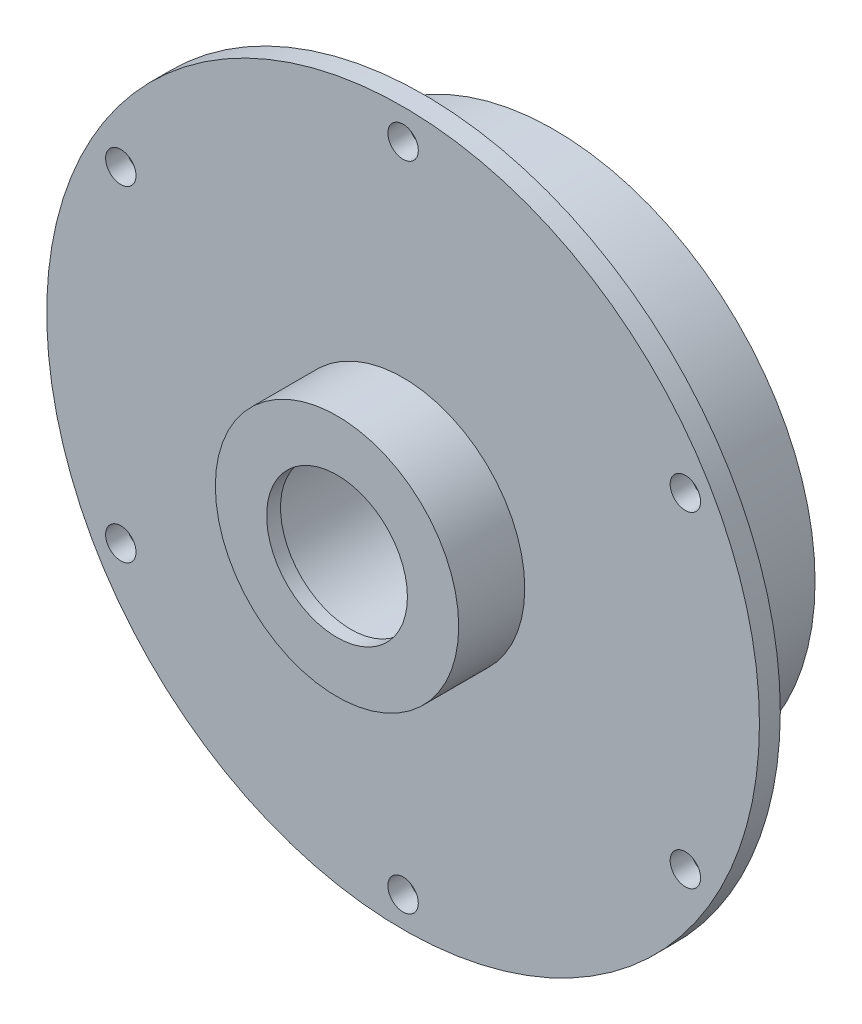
ISO-10303-21;
HEADER;
FILE_DESCRIPTION(('STEP AP214'),'2;1');
FILE_NAME('part.step','',(''),(''),'','','');
FILE_SCHEMA(('AUTOMOTIVE_DESIGN { 1 0 10303 214 1 1 1 1 }'));
ENDSEC;
DATA;
#1=APPLICATION_CONTEXT('core data for automotive mechanical design processes');
#2=APPLICATION_PROTOCOL_DEFINITION('international standard','automotive_design',2000,#1);
#3=PRODUCT_CONTEXT('',#1,'mechanical');
#4=PRODUCT('Part','Part','',(#3));
#5=PRODUCT_RELATED_PRODUCT_CATEGORY('part','',(#4));
#6=PRODUCT_DEFINITION_FORMATION('','',#4);
#7=PRODUCT_DEFINITION_CONTEXT('part definition',#1,'design');
#8=PRODUCT_DEFINITION('design','',#6,#7);
#9=PRODUCT_DEFINITION_SHAPE('','',#8);
#10=(LENGTH_UNIT() NAMED_UNIT(*) SI_UNIT(.MILLI.,.METRE.));
#11=(NAMED_UNIT(*) PLANE_ANGLE_UNIT() SI_UNIT($,.RADIAN.));
#12=(NAMED_UNIT(*) SI_UNIT($,.STERADIAN.) SOLID_ANGLE_UNIT());
#13=UNCERTAINTY_MEASURE_WITH_UNIT(LENGTH_MEASURE(1.E-05),#10,'distance_accuracy_value','');
#14=(GEOMETRIC_REPRESENTATION_CONTEXT(3) GLOBAL_UNCERTAINTY_ASSIGNED_CONTEXT((#13)) GLOBAL_UNIT_ASSIGNED_CONTEXT((#10,
#11,#12)) REPRESENTATION_CONTEXT('',''));
#15=CARTESIAN_POINT('',(0.,0.,0.));
#16=DIRECTION('',(0.,0.,1.));
#17=DIRECTION('',(1.,0.,0.));
#18=AXIS2_PLACEMENT_3D('',#15,#16,#17);
#19=CARTESIAN_POINT('',(0.,50.,-8.));
#20=DIRECTION('',(0.,0.,1.));
#21=DIRECTION('',(1.,0.,0.));
#22=AXIS2_PLACEMENT_3D('',#19,#20,#21);
#23=PLANE('',#22);
#24=CARTESIAN_POINT('',(0.,0.,-8.));
#25=DIRECTION('',(0.,0.,1.));
#26=DIRECTION('',(1.,0.,0.));
#27=AXIS2_PLACEMENT_3D('',#24,#25,#26);
#28=CIRCLE('',#27,50.);
#29=CARTESIAN_POINT('',(50.,0.,-8.));
#30=VERTEX_POINT('',#29);
#31=EDGE_CURVE('E197',#30,#30,#28,.T.);
#32=ORIENTED_EDGE('',*,*,#31,.F.);
#33=EDGE_LOOP('',(#32));
#34=FACE_BOUND('',#33,.T.);
#35=CARTESIAN_POINT('',(0.,0.,-8.));
#36=DIRECTION('',(0.,0.,1.));
#37=DIRECTION('',(1.,0.,0.));
#38=AXIS2_PLACEMENT_3D('',#35,#36,#37);
#39=CIRCLE('',#38,40.5);
#40=CARTESIAN_POINT('',(40.5,0.,-8.));
#41=VERTEX_POINT('',#40);
#42=EDGE_CURVE('E11',#41,#41,#39,.T.);
#43=ORIENTED_EDGE('',*,*,#42,.T.);
#44=EDGE_LOOP('',(#43));
#45=FACE_BOUND('',#44,.T.);
#46=ADVANCED_FACE('F36',(#34,#45),#23,.F.);
#47=CARTESIAN_POINT('',(0.,0.,0.));
#48=DIRECTION('',(0.,0.,1.));
#49=DIRECTION('',(1.,0.,0.));
#50=AXIS2_PLACEMENT_3D('',#47,#48,#49);
#51=CYLINDRICAL_SURFACE('',#50,40.5);
#52=ORIENTED_EDGE('',*,*,#42,.F.);
#53=EDGE_LOOP('',(#52));
#54=FACE_BOUND('',#53,.T.);
#55=CARTESIAN_POINT('',(0.,0.,0.));
#56=DIRECTION('',(0.,0.,1.));
#57=DIRECTION('',(1.,0.,0.));
#58=AXIS2_PLACEMENT_3D('',#55,#56,#57);
#59=CIRCLE('',#58,40.5);
#60=CARTESIAN_POINT('',(40.5,0.,0.));
#61=VERTEX_POINT('',#60);
#62=EDGE_CURVE('E43',#61,#61,#59,.T.);
#63=ORIENTED_EDGE('',*,*,#62,.T.);
#64=EDGE_LOOP('',(#63));
#65=FACE_BOUND('',#64,.T.);
#66=ADVANCED_FACE('F235',(#54,#65),#51,.F.);
#67=CARTESIAN_POINT('',(0.,40.5,0.));
#68=DIRECTION('',(0.,0.,-1.));
#69=DIRECTION('',(-1.,0.,0.));
#70=AXIS2_PLACEMENT_3D('',#67,#68,#69);
#71=PLANE('',#70);
#72=ORIENTED_EDGE('',*,*,#62,.F.);
#73=EDGE_LOOP('',(#72));
#74=FACE_BOUND('',#73,.T.);
#75=CARTESIAN_POINT('',(0.,0.,0.));
#76=DIRECTION('',(0.,0.,1.));
#77=DIRECTION('',(1.,0.,0.));
#78=AXIS2_PLACEMENT_3D('',#75,#76,#77);
#79=CIRCLE('',#78,70.);
#80=CARTESIAN_POINT('',(70.,0.,0.));
#81=VERTEX_POINT('',#80);
#82=EDGE_CURVE('E230',#81,#81,#79,.T.);
#83=ORIENTED_EDGE('',*,*,#82,.T.);
#84=EDGE_LOOP('',(#83));
#85=FACE_BOUND('',#84,.T.);
#86=ADVANCED_FACE('F237',(#74,#85),#71,.F.);
#87=CARTESIAN_POINT('',(0.,0.,0.));
#88=DIRECTION('',(0.,0.,1.));
#89=DIRECTION('',(1.,0.,0.));
#90=AXIS2_PLACEMENT_3D('',#87,#88,#89);
#91=CYLINDRICAL_SURFACE('',#90,70.);
#92=ORIENTED_EDGE('',*,*,#82,.F.);
#93=EDGE_LOOP('',(#92));
#94=FACE_BOUND('',#93,.T.);
#95=CARTESIAN_POINT('',(0.,0.,-38.));
#96=DIRECTION('',(0.,0.,1.));
#97=DIRECTION('',(1.,0.,0.));
#98=AXIS2_PLACEMENT_3D('',#95,#96,#97);
#99=CIRCLE('',#98,70.);
#100=CARTESIAN_POINT('',(70.,0.,-38.));
#101=VERTEX_POINT('',#100);
#102=EDGE_CURVE('E227',#101,#101,#99,.T.);
#103=ORIENTED_EDGE('',*,*,#102,.T.);
#104=EDGE_LOOP('',(#103));
#105=FACE_BOUND('',#104,.T.);
#106=ADVANCED_FACE('F240',(#94,#105),#91,.T.);
#107=CARTESIAN_POINT('',(0.,70.,-38.));
#108=DIRECTION('',(0.,0.,-1.));
#109=DIRECTION('',(-1.,0.,0.));
#110=AXIS2_PLACEMENT_3D('',#107,#108,#109);
#111=PLANE('',#110);
#112=CARTESIAN_POINT('',(162.379763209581,93.7500000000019,-38.));
#113=DIRECTION('',(0.,0.,1.));
#114=DIRECTION('',(1.,0.,0.));
#115=AXIS2_PLACEMENT_3D('',#112,#113,#114);
#116=CIRCLE('',#115,8.74999999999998);
#117=CARTESIAN_POINT('',(171.129763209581,93.7500000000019,-38.));
#118=VERTEX_POINT('',#117);
#119=EDGE_CURVE('E125',#118,#118,#116,.T.);
#120=ORIENTED_EDGE('',*,*,#119,.F.);
#121=EDGE_LOOP('',(#120));
#122=FACE_BOUND('',#121,.T.);
#123=CARTESIAN_POINT('',(162.379763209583,-93.7499999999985,-38.));
#124=DIRECTION('',(0.,0.,1.));
#125=DIRECTION('',(1.,0.,0.));
#126=AXIS2_PLACEMENT_3D('',#123,#124,#125);
#127=CIRCLE('',#126,8.74999999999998);
#128=CARTESIAN_POINT('',(171.129763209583,-93.7499999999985,-38.));
#129=VERTEX_POINT('',#128);
#130=EDGE_CURVE('E131',#129,#129,#127,.T.);
#131=ORIENTED_EDGE('',*,*,#130,.F.);
#132=EDGE_LOOP('',(#131));
#133=FACE_BOUND('',#132,.T.);
#134=CARTESIAN_POINT('',(0.,-187.5,-38.));
#135=DIRECTION('',(0.,0.,1.));
#136=DIRECTION('',(1.,0.,0.));
#137=AXIS2_PLACEMENT_3D('',#134,#135,#136);
#138=CIRCLE('',#137,8.74999999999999);
#139=CARTESIAN_POINT('',(8.74999999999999,-187.5,-38.));
#140=VERTEX_POINT('',#139);
#141=EDGE_CURVE('E137',#140,#140,#138,.T.);
#142=ORIENTED_EDGE('',*,*,#141,.F.);
#143=EDGE_LOOP('',(#142));
#144=FACE_BOUND('',#143,.T.);
#145=CARTESIAN_POINT('',(-162.379763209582,-93.7500000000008,-38.));
#146=DIRECTION('',(0.,0.,1.));
#147=DIRECTION('',(1.,0.,0.));
#148=AXIS2_PLACEMENT_3D('',#145,#146,#147);
#149=CIRCLE('',#148,8.74999999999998);
#150=CARTESIAN_POINT('',(-153.629763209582,-93.7500000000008,-38.));
#151=VERTEX_POINT('',#150);
#152=EDGE_CURVE('E143',#151,#151,#149,.T.);
#153=ORIENTED_EDGE('',*,*,#152,.F.);
#154=EDGE_LOOP('',(#153));
#155=FACE_BOUND('',#154,.T.);
#156=CARTESIAN_POINT('',(-162.379763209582,93.7499999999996,-38.));
#157=DIRECTION('',(0.,0.,1.));
#158=DIRECTION('',(1.,0.,0.));
#159=AXIS2_PLACEMENT_3D('',#156,#157,#158);
#160=CIRCLE('',#159,8.74999999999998);
#161=CARTESIAN_POINT('',(-153.629763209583,93.7499999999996,-38.));
#162=VERTEX_POINT('',#161);
#163=EDGE_CURVE('E149',#162,#162,#160,.T.);
#164=ORIENTED_EDGE('',*,*,#163,.F.);
#165=EDGE_LOOP('',(#164));
#166=FACE_BOUND('',#165,.T.);
#167=CARTESIAN_POINT('',(0.,187.5,-38.));
#168=DIRECTION('',(0.,0.,1.));
#169=DIRECTION('',(1.,0.,0.));
#170=AXIS2_PLACEMENT_3D('',#167,#168,#169);
#171=CIRCLE('',#170,8.74999999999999);
#172=CARTESIAN_POINT('',(8.74999999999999,187.5,-38.));
#173=VERTEX_POINT('',#172);
#174=EDGE_CURVE('E155',#173,#173,#171,.T.);
#175=ORIENTED_EDGE('',*,*,#174,.F.);
#176=EDGE_LOOP('',(#175));
#177=FACE_BOUND('',#176,.T.);
#178=ORIENTED_EDGE('',*,*,#102,.F.);
#179=EDGE_LOOP('',(#178));
#180=FACE_BOUND('',#179,.T.);
#181=CARTESIAN_POINT('',(0.,0.,-38.));
#182=DIRECTION('',(0.,0.,1.));
#183=DIRECTION('',(1.,0.,0.));
#184=AXIS2_PLACEMENT_3D('',#181,#182,#183);
#185=CIRCLE('',#184,205.);
#186=CARTESIAN_POINT('',(205.,0.,-38.));
#187=VERTEX_POINT('',#186);
#188=EDGE_CURVE('E224',#187,#187,#185,.T.);
#189=ORIENTED_EDGE('',*,*,#188,.T.);
#190=EDGE_LOOP('',(#189));
#191=FACE_BOUND('',#190,.T.);
#192=ADVANCED_FACE('F246',(#122,#133,#144,#155,#166,#177,#180,#191),#111,.F.);
#193=CARTESIAN_POINT('',(0.,0.,0.));
#194=DIRECTION('',(0.,0.,1.));
#195=DIRECTION('',(1.,0.,0.));
#196=AXIS2_PLACEMENT_3D('',#193,#194,#195);
#197=CYLINDRICAL_SURFACE('',#196,205.);
#198=ORIENTED_EDGE('',*,*,#188,.F.);
#199=EDGE_LOOP('',(#198));
#200=FACE_BOUND('',#199,.T.);
#201=CARTESIAN_POINT('',(0.,0.,-50.));
#202=DIRECTION('',(0.,0.,1.));
#203=DIRECTION('',(1.,0.,0.));
#204=AXIS2_PLACEMENT_3D('',#201,#202,#203);
#205=CIRCLE('',#204,205.);
#206=CARTESIAN_POINT('',(205.,0.,-50.));
#207=VERTEX_POINT('',#206);
#208=EDGE_CURVE('E221',#207,#207,#205,.T.);
#209=ORIENTED_EDGE('',*,*,#208,.T.);
#210=EDGE_LOOP('',(#209));
#211=FACE_BOUND('',#210,.T.);
#212=ADVANCED_FACE('F252',(#200,#211),#197,.T.);
#213=CARTESIAN_POINT('',(0.,205.,-50.));
#214=DIRECTION('',(0.,0.,1.));
#215=DIRECTION('',(1.,0.,0.));
#216=AXIS2_PLACEMENT_3D('',#213,#214,#215);
#217=PLANE('',#216);
#218=CARTESIAN_POINT('',(162.379763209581,93.7500000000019,-50.));
#219=DIRECTION('',(0.,0.,1.));
#220=DIRECTION('',(1.,0.,0.));
#221=AXIS2_PLACEMENT_3D('',#218,#219,#220);
#222=CIRCLE('',#221,8.74999999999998);
#223=CARTESIAN_POINT('',(171.129763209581,93.7500000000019,-50.));
#224=VERTEX_POINT('',#223);
#225=EDGE_CURVE('E128',#224,#224,#222,.T.);
#226=ORIENTED_EDGE('',*,*,#225,.T.);
#227=EDGE_LOOP('',(#226));
#228=FACE_BOUND('',#227,.T.);
#229=CARTESIAN_POINT('',(162.379763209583,-93.7499999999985,-50.));
#230=DIRECTION('',(0.,0.,1.));
#231=DIRECTION('',(1.,0.,0.));
#232=AXIS2_PLACEMENT_3D('',#229,#230,#231);
#233=CIRCLE('',#232,8.74999999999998);
#234=CARTESIAN_POINT('',(171.129763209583,-93.7499999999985,-50.));
#235=VERTEX_POINT('',#234);
#236=EDGE_CURVE('E134',#235,#235,#233,.T.);
#237=ORIENTED_EDGE('',*,*,#236,.T.);
#238=EDGE_LOOP('',(#237));
#239=FACE_BOUND('',#238,.T.);
#240=CARTESIAN_POINT('',(0.,-187.5,-50.));
#241=DIRECTION('',(0.,0.,1.));
#242=DIRECTION('',(1.,0.,0.));
#243=AXIS2_PLACEMENT_3D('',#240,#241,#242);
#244=CIRCLE('',#243,8.74999999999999);
#245=CARTESIAN_POINT('',(8.74999999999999,-187.5,-50.));
#246=VERTEX_POINT('',#245);
#247=EDGE_CURVE('E140',#246,#246,#244,.T.);
#248=ORIENTED_EDGE('',*,*,#247,.T.);
#249=EDGE_LOOP('',(#248));
#250=FACE_BOUND('',#249,.T.);
#251=CARTESIAN_POINT('',(-162.379763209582,-93.7500000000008,-50.));
#252=DIRECTION('',(0.,0.,1.));
#253=DIRECTION('',(1.,0.,0.));
#254=AXIS2_PLACEMENT_3D('',#251,#252,#253);
#255=CIRCLE('',#254,8.74999999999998);
#256=CARTESIAN_POINT('',(-153.629763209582,-93.7500000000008,-50.));
#257=VERTEX_POINT('',#256);
#258=EDGE_CURVE('E146',#257,#257,#255,.T.);
#259=ORIENTED_EDGE('',*,*,#258,.T.);
#260=EDGE_LOOP('',(#259));
#261=FACE_BOUND('',#260,.T.);
#262=CARTESIAN_POINT('',(-162.379763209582,93.7499999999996,-50.));
#263=DIRECTION('',(0.,0.,1.));
#264=DIRECTION('',(1.,0.,0.));
#265=AXIS2_PLACEMENT_3D('',#262,#263,#264);
#266=CIRCLE('',#265,8.74999999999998);
#267=CARTESIAN_POINT('',(-153.629763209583,93.7499999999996,-50.));
#268=VERTEX_POINT('',#267);
#269=EDGE_CURVE('E152',#268,#268,#266,.T.);
#270=ORIENTED_EDGE('',*,*,#269,.T.);
#271=EDGE_LOOP('',(#270));
#272=FACE_BOUND('',#271,.T.);
#273=CARTESIAN_POINT('',(0.,187.5,-50.));
#274=DIRECTION('',(0.,0.,1.));
#275=DIRECTION('',(1.,0.,0.));
#276=AXIS2_PLACEMENT_3D('',#273,#274,#275);
#277=CIRCLE('',#276,8.74999999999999);
#278=CARTESIAN_POINT('',(8.74999999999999,187.5,-50.));
#279=VERTEX_POINT('',#278);
#280=EDGE_CURVE('E158',#279,#279,#277,.T.);
#281=ORIENTED_EDGE('',*,*,#280,.T.);
#282=EDGE_LOOP('',(#281));
#283=FACE_BOUND('',#282,.T.);
#284=ORIENTED_EDGE('',*,*,#208,.F.);
#285=EDGE_LOOP('',(#284));
#286=FACE_BOUND('',#285,.T.);
#287=CARTESIAN_POINT('',(0.,0.,-50.));
#288=DIRECTION('',(0.,0.,1.));
#289=DIRECTION('',(1.,0.,0.));
#290=AXIS2_PLACEMENT_3D('',#287,#288,#289);
#291=CIRCLE('',#290,150.);
#292=CARTESIAN_POINT('',(150.,0.,-50.));
#293=VERTEX_POINT('',#292);
#294=EDGE_CURVE('E218',#293,#293,#291,.T.);
#295=ORIENTED_EDGE('',*,*,#294,.T.);
#296=EDGE_LOOP('',(#295));
#297=FACE_BOUND('',#296,.T.);
#298=ADVANCED_FACE('F259',(#228,#239,#250,#261,#272,#283,#286,#297),#217,.F.);
#299=CARTESIAN_POINT('',(0.,0.,0.));
#300=DIRECTION('',(0.,0.,1.));
#301=DIRECTION('',(1.,0.,0.));
#302=AXIS2_PLACEMENT_3D('',#299,#300,#301);
#303=CYLINDRICAL_SURFACE('',#302,150.);
#304=ORIENTED_EDGE('',*,*,#294,.F.);
#305=EDGE_LOOP('',(#304));
#306=FACE_BOUND('',#305,.T.);
#307=CARTESIAN_POINT('',(0.,0.,-125.));
#308=DIRECTION('',(0.,0.,1.));
#309=DIRECTION('',(1.,0.,0.));
#310=AXIS2_PLACEMENT_3D('',#307,#308,#309);
#311=CIRCLE('',#310,150.);
#312=CARTESIAN_POINT('',(150.,0.,-125.));
#313=VERTEX_POINT('',#312);
#314=EDGE_CURVE('E215',#313,#313,#311,.T.);
#315=ORIENTED_EDGE('',*,*,#314,.T.);
#316=EDGE_LOOP('',(#315));
#317=FACE_BOUND('',#316,.T.);
#318=ADVANCED_FACE('F265',(#306,#317),#303,.T.);
#319=CARTESIAN_POINT('',(0.,150.,-125.));
#320=DIRECTION('',(0.,0.,1.));
#321=DIRECTION('',(1.,0.,0.));
#322=AXIS2_PLACEMENT_3D('',#319,#320,#321);
#323=PLANE('',#322);
#324=CARTESIAN_POINT('',(112.583302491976,65.0000000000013,-125.));
#325=DIRECTION('',(0.,0.,-1.));
#326=DIRECTION('',(-1.,0.,0.));
#327=AXIS2_PLACEMENT_3D('',#324,#325,#326);
#328=CIRCLE('',#327,6.99999999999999);
#329=CARTESIAN_POINT('',(105.583302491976,65.0000000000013,-125.));
#330=VERTEX_POINT('',#329);
#331=EDGE_CURVE('E161',#330,#330,#328,.T.);
#332=ORIENTED_EDGE('',*,*,#331,.F.);
#333=EDGE_LOOP('',(#332));
#334=FACE_BOUND('',#333,.T.);
#335=CARTESIAN_POINT('',(112.583302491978,-64.999999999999,-125.));
#336=DIRECTION('',(0.,0.,-1.));
#337=DIRECTION('',(-1.,0.,0.));
#338=AXIS2_PLACEMENT_3D('',#335,#336,#337);
#339=CIRCLE('',#338,6.99999999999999);
#340=CARTESIAN_POINT('',(105.583302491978,-64.999999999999,-125.));
#341=VERTEX_POINT('',#340);
#342=EDGE_CURVE('E167',#341,#341,#339,.T.);
#343=ORIENTED_EDGE('',*,*,#342,.F.);
#344=EDGE_LOOP('',(#343));
#345=FACE_BOUND('',#344,.T.);
#346=CARTESIAN_POINT('',(0.,-130.,-125.));
#347=DIRECTION('',(0.,0.,-1.));
#348=DIRECTION('',(-1.,0.,0.));
#349=AXIS2_PLACEMENT_3D('',#346,#347,#348);
#350=CIRCLE('',#349,6.99999999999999);
#351=CARTESIAN_POINT('',(-6.99999999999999,-130.,-125.));
#352=VERTEX_POINT('',#351);
#353=EDGE_CURVE('E173',#352,#352,#350,.T.);
#354=ORIENTED_EDGE('',*,*,#353,.F.);
#355=EDGE_LOOP('',(#354));
#356=FACE_BOUND('',#355,.T.);
#357=CARTESIAN_POINT('',(-112.583302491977,-65.0000000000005,-125.));
#358=DIRECTION('',(0.,0.,-1.));
#359=DIRECTION('',(-1.,0.,0.));
#360=AXIS2_PLACEMENT_3D('',#357,#358,#359);
#361=CIRCLE('',#360,6.99999999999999);
#362=CARTESIAN_POINT('',(-119.583302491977,-65.0000000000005,-125.));
#363=VERTEX_POINT('',#362);
#364=EDGE_CURVE('E179',#363,#363,#361,.T.);
#365=ORIENTED_EDGE('',*,*,#364,.F.);
#366=EDGE_LOOP('',(#365));
#367=FACE_BOUND('',#366,.T.);
#368=CARTESIAN_POINT('',(-112.583302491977,64.9999999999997,-125.));
#369=DIRECTION('',(0.,0.,-1.));
#370=DIRECTION('',(-1.,0.,0.));
#371=AXIS2_PLACEMENT_3D('',#368,#369,#370);
#372=CIRCLE('',#371,6.99999999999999);
#373=CARTESIAN_POINT('',(-119.583302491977,64.9999999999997,-125.));
#374=VERTEX_POINT('',#373);
#375=EDGE_CURVE('E185',#374,#374,#372,.T.);
#376=ORIENTED_EDGE('',*,*,#375,.F.);
#377=EDGE_LOOP('',(#376));
#378=FACE_BOUND('',#377,.T.);
#379=CARTESIAN_POINT('',(0.,130.,-125.));
#380=DIRECTION('',(0.,0.,-1.));
#381=DIRECTION('',(-1.,0.,0.));
#382=AXIS2_PLACEMENT_3D('',#379,#380,#381);
#383=CIRCLE('',#382,6.99999999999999);
#384=CARTESIAN_POINT('',(-6.99999999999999,130.,-125.));
#385=VERTEX_POINT('',#384);
#386=EDGE_CURVE('E191',#385,#385,#383,.T.);
#387=ORIENTED_EDGE('',*,*,#386,.F.);
#388=EDGE_LOOP('',(#387));
#389=FACE_BOUND('',#388,.T.);
#390=ORIENTED_EDGE('',*,*,#314,.F.);
#391=EDGE_LOOP('',(#390));
#392=FACE_BOUND('',#391,.T.);
#393=CARTESIAN_POINT('',(0.,0.,-125.));
#394=DIRECTION('',(0.,0.,1.));
#395=DIRECTION('',(1.,0.,0.));
#396=AXIS2_PLACEMENT_3D('',#393,#394,#395);
#397=CIRCLE('',#396,110.);
#398=CARTESIAN_POINT('',(110.,0.,-125.));
#399=VERTEX_POINT('',#398);
#400=EDGE_CURVE('E212',#399,#399,#397,.T.);
#401=ORIENTED_EDGE('',*,*,#400,.T.);
#402=EDGE_LOOP('',(#401));
#403=FACE_BOUND('',#402,.T.);
#404=ADVANCED_FACE('F272',(#334,#345,#356,#367,#378,#389,#392,#403),#323,.F.);
#405=CARTESIAN_POINT('',(0.,0.,0.));
#406=DIRECTION('',(0.,0.,1.));
#407=DIRECTION('',(1.,0.,0.));
#408=AXIS2_PLACEMENT_3D('',#405,#406,#407);
#409=CYLINDRICAL_SURFACE('',#408,110.);
#410=ORIENTED_EDGE('',*,*,#400,.F.);
#411=EDGE_LOOP('',(#410));
#412=FACE_BOUND('',#411,.T.);
#413=CARTESIAN_POINT('',(0.,0.,-50.));
#414=DIRECTION('',(0.,0.,1.));
#415=DIRECTION('',(1.,0.,0.));
#416=AXIS2_PLACEMENT_3D('',#413,#414,#415);
#417=CIRCLE('',#416,110.);
#418=CARTESIAN_POINT('',(110.,0.,-50.));
#419=VERTEX_POINT('',#418);
#420=EDGE_CURVE('E209',#419,#419,#417,.T.);
#421=ORIENTED_EDGE('',*,*,#420,.T.);
#422=EDGE_LOOP('',(#421));
#423=FACE_BOUND('',#422,.T.);
#424=ADVANCED_FACE('F278',(#412,#423),#409,.F.);
#425=CARTESIAN_POINT('',(0.,110.,-50.));
#426=DIRECTION('',(0.,0.,1.));
#427=DIRECTION('',(1.,0.,0.));
#428=AXIS2_PLACEMENT_3D('',#425,#426,#427);
#429=PLANE('',#428);
#430=ORIENTED_EDGE('',*,*,#420,.F.);
#431=EDGE_LOOP('',(#430));
#432=FACE_BOUND('',#431,.T.);
#433=CARTESIAN_POINT('',(0.,0.,-50.));
#434=DIRECTION('',(0.,0.,1.));
#435=DIRECTION('',(1.,0.,0.));
#436=AXIS2_PLACEMENT_3D('',#433,#434,#435);
#437=CIRCLE('',#436,70.);
#438=CARTESIAN_POINT('',(70.,0.,-50.));
#439=VERTEX_POINT('',#438);
#440=EDGE_CURVE('E206',#439,#439,#437,.T.);
#441=ORIENTED_EDGE('',*,*,#440,.T.);
#442=EDGE_LOOP('',(#441));
#443=FACE_BOUND('',#442,.T.);
#444=ADVANCED_FACE('F285',(#432,#443),#429,.F.);
#445=CARTESIAN_POINT('',(0.,0.,0.));
#446=DIRECTION('',(0.,0.,1.));
#447=DIRECTION('',(1.,0.,0.));
#448=AXIS2_PLACEMENT_3D('',#445,#446,#447);
#449=CYLINDRICAL_SURFACE('',#448,70.);
#450=ORIENTED_EDGE('',*,*,#440,.F.);
#451=EDGE_LOOP('',(#450));
#452=FACE_BOUND('',#451,.T.);
#453=CARTESIAN_POINT('',(0.,0.,-65.));
#454=DIRECTION('',(0.,0.,1.));
#455=DIRECTION('',(1.,0.,0.));
#456=AXIS2_PLACEMENT_3D('',#453,#454,#455);
#457=CIRCLE('',#456,70.);
#458=CARTESIAN_POINT('',(70.,0.,-65.));
#459=VERTEX_POINT('',#458);
#460=EDGE_CURVE('E203',#459,#459,#457,.T.);
#461=ORIENTED_EDGE('',*,*,#460,.T.);
#462=EDGE_LOOP('',(#461));
#463=FACE_BOUND('',#462,.T.);
#464=ADVANCED_FACE('F291',(#452,#463),#449,.T.);
#465=CARTESIAN_POINT('',(0.,70.,-65.));
#466=DIRECTION('',(0.,0.,1.));
#467=DIRECTION('',(1.,0.,0.));
#468=AXIS2_PLACEMENT_3D('',#465,#466,#467);
#469=PLANE('',#468);
#470=CARTESIAN_POINT('',(51.961524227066,30.0000000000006,-65.));
#471=DIRECTION('',(0.,0.,-1.));
#472=DIRECTION('',(-1.,0.,0.));
#473=AXIS2_PLACEMENT_3D('',#470,#471,#472);
#474=CIRCLE('',#473,3.39999999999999);
#475=CARTESIAN_POINT('',(48.561524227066,30.0000000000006,-65.));
#476=VERTEX_POINT('',#475);
#477=EDGE_CURVE('E91',#476,#476,#474,.T.);
#478=ORIENTED_EDGE('',*,*,#477,.F.);
#479=EDGE_LOOP('',(#478));
#480=FACE_BOUND('',#479,.T.);
#481=CARTESIAN_POINT('',(51.9615242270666,-29.9999999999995,-65.));
#482=DIRECTION('',(0.,0.,-1.));
#483=DIRECTION('',(-1.,0.,0.));
#484=AXIS2_PLACEMENT_3D('',#481,#482,#483);
#485=CIRCLE('',#484,3.4);
#486=CARTESIAN_POINT('',(48.5615242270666,-29.9999999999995,-65.));
#487=VERTEX_POINT('',#486);
#488=EDGE_CURVE('E90',#487,#487,#485,.T.);
#489=ORIENTED_EDGE('',*,*,#488,.F.);
#490=EDGE_LOOP('',(#489));
#491=FACE_BOUND('',#490,.T.);
#492=CARTESIAN_POINT('',(0.,-60.,-65.));
#493=DIRECTION('',(0.,0.,-1.));
#494=DIRECTION('',(-1.,0.,0.));
#495=AXIS2_PLACEMENT_3D('',#492,#493,#494);
#496=CIRCLE('',#495,3.4);
#497=CARTESIAN_POINT('',(-3.4,-60.,-65.));
#498=VERTEX_POINT('',#497);
#499=EDGE_CURVE('E101',#498,#498,#496,.T.);
#500=ORIENTED_EDGE('',*,*,#499,.F.);
#501=EDGE_LOOP('',(#500));
#502=FACE_BOUND('',#501,.T.);
#503=CARTESIAN_POINT('',(-51.9615242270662,-30.0000000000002,-65.));
#504=DIRECTION('',(0.,0.,-1.));
#505=DIRECTION('',(-1.,0.,0.));
#506=AXIS2_PLACEMENT_3D('',#503,#504,#505);
#507=CIRCLE('',#506,3.39999999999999);
#508=CARTESIAN_POINT('',(-55.3615242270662,-30.0000000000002,-65.));
#509=VERTEX_POINT('',#508);
#510=EDGE_CURVE('E107',#509,#509,#507,.T.);
#511=ORIENTED_EDGE('',*,*,#510,.F.);
#512=EDGE_LOOP('',(#511));
#513=FACE_BOUND('',#512,.T.);
#514=CARTESIAN_POINT('',(-51.9615242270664,29.9999999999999,-65.));
#515=DIRECTION('',(0.,0.,-1.));
#516=DIRECTION('',(-1.,0.,0.));
#517=AXIS2_PLACEMENT_3D('',#514,#515,#516);
#518=CIRCLE('',#517,3.4);
#519=CARTESIAN_POINT('',(-55.3615242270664,29.9999999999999,-65.));
#520=VERTEX_POINT('',#519);
#521=EDGE_CURVE('E113',#520,#520,#518,.T.);
#522=ORIENTED_EDGE('',*,*,#521,.F.);
#523=EDGE_LOOP('',(#522));
#524=FACE_BOUND('',#523,.T.);
#525=CARTESIAN_POINT('',(0.,60.,-65.));
#526=DIRECTION('',(0.,0.,-1.));
#527=DIRECTION('',(-1.,0.,0.));
#528=AXIS2_PLACEMENT_3D('',#525,#526,#527);
#529=CIRCLE('',#528,3.4);
#530=CARTESIAN_POINT('',(-3.4,60.,-65.));
#531=VERTEX_POINT('',#530);
#532=EDGE_CURVE('E119',#531,#531,#529,.T.);
#533=ORIENTED_EDGE('',*,*,#532,.F.);
#534=EDGE_LOOP('',(#533));
#535=FACE_BOUND('',#534,.T.);
#536=ORIENTED_EDGE('',*,*,#460,.F.);
#537=EDGE_LOOP('',(#536));
#538=FACE_BOUND('',#537,.T.);
#539=CARTESIAN_POINT('',(0.,0.,-65.));
#540=DIRECTION('',(0.,0.,1.));
#541=DIRECTION('',(1.,0.,0.));
#542=AXIS2_PLACEMENT_3D('',#539,#540,#541);
#543=CIRCLE('',#542,50.);
#544=CARTESIAN_POINT('',(50.,0.,-65.));
#545=VERTEX_POINT('',#544);
#546=EDGE_CURVE('E200',#545,#545,#543,.T.);
#547=ORIENTED_EDGE('',*,*,#546,.T.);
#548=EDGE_LOOP('',(#547));
#549=FACE_BOUND('',#548,.T.);
#550=ADVANCED_FACE('F297',(#480,#491,#502,#513,#524,#535,#538,#549),#469,.F.);
#551=CARTESIAN_POINT('',(0.,0.,0.));
#552=DIRECTION('',(0.,0.,1.));
#553=DIRECTION('',(1.,0.,0.));
#554=AXIS2_PLACEMENT_3D('',#551,#552,#553);
#555=CYLINDRICAL_SURFACE('',#554,50.);
#556=ORIENTED_EDGE('',*,*,#546,.F.);
#557=EDGE_LOOP('',(#556));
#558=FACE_BOUND('',#557,.T.);
#559=ORIENTED_EDGE('',*,*,#31,.T.);
#560=EDGE_LOOP('',(#559));
#561=FACE_BOUND('',#560,.T.);
#562=ADVANCED_FACE('F303',(#558,#561),#555,.F.);
#563=CARTESIAN_POINT('',(0.,130.,-77.));
#564=DIRECTION('',(0.,0.,-1.));
#565=DIRECTION('',(-1.,0.,0.));
#566=AXIS2_PLACEMENT_3D('',#563,#564,#565);
#567=CONICAL_SURFACE('',#566,6.99999999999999,1.02974425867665);
#568=CARTESIAN_POINT('',(0.,130.,-72.7939756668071));
#569=VERTEX_POINT('',#568);
#570=VERTEX_LOOP('',#569);
#571=FACE_BOUND('',#570,.T.);
#572=CARTESIAN_POINT('',(0.,130.,-77.));
#573=DIRECTION('',(0.,0.,-1.));
#574=DIRECTION('',(-1.,0.,0.));
#575=AXIS2_PLACEMENT_3D('',#572,#573,#574);
#576=CIRCLE('',#575,6.99999999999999);
#577=CARTESIAN_POINT('',(-6.99999999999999,130.,-77.));
#578=VERTEX_POINT('',#577);
#579=EDGE_CURVE('E194',#578,#578,#576,.T.);
#580=ORIENTED_EDGE('',*,*,#579,.T.);
#581=EDGE_LOOP('',(#580));
#582=FACE_BOUND('',#581,.T.);
#583=ADVANCED_FACE('F310',(#571,#582),#567,.F.);
#584=CARTESIAN_POINT('',(0.,130.,-125.));
#585=DIRECTION('',(0.,0.,-1.));
#586=DIRECTION('',(-1.,0.,0.));
#587=AXIS2_PLACEMENT_3D('',#584,#585,#586);
#588=CYLINDRICAL_SURFACE('',#587,6.99999999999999);
#589=ORIENTED_EDGE('',*,*,#579,.F.);
#590=EDGE_LOOP('',(#589));
#591=FACE_BOUND('',#590,.T.);
#592=ORIENTED_EDGE('',*,*,#386,.T.);
#593=EDGE_LOOP('',(#592));
#594=FACE_BOUND('',#593,.T.);
#595=ADVANCED_FACE('F324',(#591,#594),#588,.F.);
#596=CARTESIAN_POINT('',(-112.583302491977,64.9999999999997,-77.));
#597=DIRECTION('',(0.,0.,-1.));
#598=DIRECTION('',(-1.,0.,0.));
#599=AXIS2_PLACEMENT_3D('',#596,#597,#598);
#600=CONICAL_SURFACE('',#599,6.99999999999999,1.02974425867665);
#601=CARTESIAN_POINT('',(-112.583302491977,64.9999999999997,-72.7939756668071));
#602=VERTEX_POINT('',#601);
#603=VERTEX_LOOP('',#602);
#604=FACE_BOUND('',#603,.T.);
#605=CARTESIAN_POINT('',(-112.583302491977,64.9999999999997,-77.));
#606=DIRECTION('',(0.,0.,-1.));
#607=DIRECTION('',(-1.,0.,0.));
#608=AXIS2_PLACEMENT_3D('',#605,#606,#607);
#609=CIRCLE('',#608,6.99999999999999);
#610=CARTESIAN_POINT('',(-119.583302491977,64.9999999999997,-77.));
#611=VERTEX_POINT('',#610);
#612=EDGE_CURVE('E188',#611,#611,#609,.T.);
#613=ORIENTED_EDGE('',*,*,#612,.T.);
#614=EDGE_LOOP('',(#613));
#615=FACE_BOUND('',#614,.T.);
#616=ADVANCED_FACE('F327',(#604,#615),#600,.F.);
#617=CARTESIAN_POINT('',(-112.583302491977,64.9999999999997,-125.));
#618=DIRECTION('',(0.,0.,-1.));
#619=DIRECTION('',(-1.,0.,0.));
#620=AXIS2_PLACEMENT_3D('',#617,#618,#619);
#621=CYLINDRICAL_SURFACE('',#620,6.99999999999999);
#622=ORIENTED_EDGE('',*,*,#612,.F.);
#623=EDGE_LOOP('',(#622));
#624=FACE_BOUND('',#623,.T.);
#625=ORIENTED_EDGE('',*,*,#375,.T.);
#626=EDGE_LOOP('',(#625));
#627=FACE_BOUND('',#626,.T.);
#628=ADVANCED_FACE('F331',(#624,#627),#621,.F.);
#629=CARTESIAN_POINT('',(-112.583302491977,-65.0000000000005,-77.));
#630=DIRECTION('',(0.,0.,-1.));
#631=DIRECTION('',(-1.,0.,0.));
#632=AXIS2_PLACEMENT_3D('',#629,#630,#631);
#633=CONICAL_SURFACE('',#632,6.99999999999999,1.02974425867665);
#634=CARTESIAN_POINT('',(-112.583302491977,-65.0000000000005,-72.7939756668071));
#635=VERTEX_POINT('',#634);
#636=VERTEX_LOOP('',#635);
#637=FACE_BOUND('',#636,.T.);
#638=CARTESIAN_POINT('',(-112.583302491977,-65.0000000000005,-77.));
#639=DIRECTION('',(0.,0.,-1.));
#640=DIRECTION('',(-1.,0.,0.));
#641=AXIS2_PLACEMENT_3D('',#638,#639,#640);
#642=CIRCLE('',#641,6.99999999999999);
#643=CARTESIAN_POINT('',(-119.583302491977,-65.0000000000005,-77.));
#644=VERTEX_POINT('',#643);
#645=EDGE_CURVE('E182',#644,#644,#642,.T.);
#646=ORIENTED_EDGE('',*,*,#645,.T.);
#647=EDGE_LOOP('',(#646));
#648=FACE_BOUND('',#647,.T.);
#649=ADVANCED_FACE('F334',(#637,#648),#633,.F.);
#650=CARTESIAN_POINT('',(-112.583302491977,-65.0000000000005,-125.));
#651=DIRECTION('',(0.,0.,-1.));
#652=DIRECTION('',(-1.,0.,0.));
#653=AXIS2_PLACEMENT_3D('',#650,#651,#652);
#654=CYLINDRICAL_SURFACE('',#653,6.99999999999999);
#655=ORIENTED_EDGE('',*,*,#645,.F.);
#656=EDGE_LOOP('',(#655));
#657=FACE_BOUND('',#656,.T.);
#658=ORIENTED_EDGE('',*,*,#364,.T.);
#659=EDGE_LOOP('',(#658));
#660=FACE_BOUND('',#659,.T.);
#661=ADVANCED_FACE('F338',(#657,#660),#654,.F.);
#662=CARTESIAN_POINT('',(0.,-130.,-77.));
#663=DIRECTION('',(0.,0.,-1.));
#664=DIRECTION('',(-1.,0.,0.));
#665=AXIS2_PLACEMENT_3D('',#662,#663,#664);
#666=CONICAL_SURFACE('',#665,6.99999999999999,1.02974425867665);
#667=CARTESIAN_POINT('',(0.,-130.,-72.7939756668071));
#668=VERTEX_POINT('',#667);
#669=VERTEX_LOOP('',#668);
#670=FACE_BOUND('',#669,.T.);
#671=CARTESIAN_POINT('',(0.,-130.,-77.));
#672=DIRECTION('',(0.,0.,-1.));
#673=DIRECTION('',(-1.,0.,0.));
#674=AXIS2_PLACEMENT_3D('',#671,#672,#673);
#675=CIRCLE('',#674,6.99999999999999);
#676=CARTESIAN_POINT('',(-6.99999999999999,-130.,-77.));
#677=VERTEX_POINT('',#676);
#678=EDGE_CURVE('E176',#677,#677,#675,.T.);
#679=ORIENTED_EDGE('',*,*,#678,.T.);
#680=EDGE_LOOP('',(#679));
#681=FACE_BOUND('',#680,.T.);
#682=ADVANCED_FACE('F342',(#670,#681),#666,.F.);
#683=CARTESIAN_POINT('',(0.,-130.,-125.));
#684=DIRECTION('',(0.,0.,-1.));
#685=DIRECTION('',(-1.,0.,0.));
#686=AXIS2_PLACEMENT_3D('',#683,#684,#685);
#687=CYLINDRICAL_SURFACE('',#686,6.99999999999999);
#688=ORIENTED_EDGE('',*,*,#678,.F.);
#689=EDGE_LOOP('',(#688));
#690=FACE_BOUND('',#689,.T.);
#691=ORIENTED_EDGE('',*,*,#353,.T.);
#692=EDGE_LOOP('',(#691));
#693=FACE_BOUND('',#692,.T.);
#694=ADVANCED_FACE('F346',(#690,#693),#687,.F.);
#695=CARTESIAN_POINT('',(112.583302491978,-64.999999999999,-77.));
#696=DIRECTION('',(0.,0.,-1.));
#697=DIRECTION('',(-1.,0.,0.));
#698=AXIS2_PLACEMENT_3D('',#695,#696,#697);
#699=CONICAL_SURFACE('',#698,6.99999999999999,1.02974425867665);
#700=CARTESIAN_POINT('',(112.583302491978,-64.999999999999,-72.7939756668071));
#701=VERTEX_POINT('',#700);
#702=VERTEX_LOOP('',#701);
#703=FACE_BOUND('',#702,.T.);
#704=CARTESIAN_POINT('',(112.583302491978,-64.999999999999,-77.));
#705=DIRECTION('',(0.,0.,-1.));
#706=DIRECTION('',(-1.,0.,0.));
#707=AXIS2_PLACEMENT_3D('',#704,#705,#706);
#708=CIRCLE('',#707,6.99999999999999);
#709=CARTESIAN_POINT('',(105.583302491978,-64.999999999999,-77.));
#710=VERTEX_POINT('',#709);
#711=EDGE_CURVE('E170',#710,#710,#708,.T.);
#712=ORIENTED_EDGE('',*,*,#711,.T.);
#713=EDGE_LOOP('',(#712));
#714=FACE_BOUND('',#713,.T.);
#715=ADVANCED_FACE('F350',(#703,#714),#699,.F.);
#716=CARTESIAN_POINT('',(112.583302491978,-64.999999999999,-125.));
#717=DIRECTION('',(0.,0.,-1.));
#718=DIRECTION('',(-1.,0.,0.));
#719=AXIS2_PLACEMENT_3D('',#716,#717,#718);
#720=CYLINDRICAL_SURFACE('',#719,6.99999999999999);
#721=ORIENTED_EDGE('',*,*,#711,.F.);
#722=EDGE_LOOP('',(#721));
#723=FACE_BOUND('',#722,.T.);
#724=ORIENTED_EDGE('',*,*,#342,.T.);
#725=EDGE_LOOP('',(#724));
#726=FACE_BOUND('',#725,.T.);
#727=ADVANCED_FACE('F354',(#723,#726),#720,.F.);
#728=CARTESIAN_POINT('',(112.583302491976,65.0000000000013,-77.));
#729=DIRECTION('',(0.,0.,-1.));
#730=DIRECTION('',(-1.,0.,0.));
#731=AXIS2_PLACEMENT_3D('',#728,#729,#730);
#732=CONICAL_SURFACE('',#731,6.99999999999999,1.02974425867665);
#733=CARTESIAN_POINT('',(112.583302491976,65.0000000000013,-72.7939756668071));
#734=VERTEX_POINT('',#733);
#735=VERTEX_LOOP('',#734);
#736=FACE_BOUND('',#735,.T.);
#737=CARTESIAN_POINT('',(112.583302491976,65.0000000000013,-77.));
#738=DIRECTION('',(0.,0.,-1.));
#739=DIRECTION('',(-1.,0.,0.));
#740=AXIS2_PLACEMENT_3D('',#737,#738,#739);
#741=CIRCLE('',#740,6.99999999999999);
#742=CARTESIAN_POINT('',(105.583302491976,65.0000000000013,-77.));
#743=VERTEX_POINT('',#742);
#744=EDGE_CURVE('E164',#743,#743,#741,.T.);
#745=ORIENTED_EDGE('',*,*,#744,.T.);
#746=EDGE_LOOP('',(#745));
#747=FACE_BOUND('',#746,.T.);
#748=ADVANCED_FACE('F358',(#736,#747),#732,.F.);
#749=CARTESIAN_POINT('',(112.583302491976,65.0000000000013,-125.));
#750=DIRECTION('',(0.,0.,-1.));
#751=DIRECTION('',(-1.,0.,0.));
#752=AXIS2_PLACEMENT_3D('',#749,#750,#751);
#753=CYLINDRICAL_SURFACE('',#752,6.99999999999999);
#754=ORIENTED_EDGE('',*,*,#744,.F.);
#755=EDGE_LOOP('',(#754));
#756=FACE_BOUND('',#755,.T.);
#757=ORIENTED_EDGE('',*,*,#331,.T.);
#758=EDGE_LOOP('',(#757));
#759=FACE_BOUND('',#758,.T.);
#760=ADVANCED_FACE('F362',(#756,#759),#753,.F.);
#761=CARTESIAN_POINT('',(0.,187.5,-38.));
#762=DIRECTION('',(0.,0.,1.));
#763=DIRECTION('',(1.,0.,0.));
#764=AXIS2_PLACEMENT_3D('',#761,#762,#763);
#765=CYLINDRICAL_SURFACE('',#764,8.74999999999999);
#766=ORIENTED_EDGE('',*,*,#174,.T.);
#767=EDGE_LOOP('',(#766));
#768=FACE_BOUND('',#767,.T.);
#769=ORIENTED_EDGE('',*,*,#280,.F.);
#770=EDGE_LOOP('',(#769));
#771=FACE_BOUND('',#770,.T.);
#772=ADVANCED_FACE('F366',(#768,#771),#765,.F.);
#773=CARTESIAN_POINT('',(-162.379763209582,93.7499999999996,-38.));
#774=DIRECTION('',(0.,0.,1.));
#775=DIRECTION('',(1.,0.,0.));
#776=AXIS2_PLACEMENT_3D('',#773,#774,#775);
#777=CYLINDRICAL_SURFACE('',#776,8.74999999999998);
#778=ORIENTED_EDGE('',*,*,#163,.T.);
#779=EDGE_LOOP('',(#778));
#780=FACE_BOUND('',#779,.T.);
#781=ORIENTED_EDGE('',*,*,#269,.F.);
#782=EDGE_LOOP('',(#781));
#783=FACE_BOUND('',#782,.T.);
#784=ADVANCED_FACE('F370',(#780,#783),#777,.F.);
#785=CARTESIAN_POINT('',(-162.379763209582,-93.7500000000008,-38.));
#786=DIRECTION('',(0.,0.,1.));
#787=DIRECTION('',(1.,0.,0.));
#788=AXIS2_PLACEMENT_3D('',#785,#786,#787);
#789=CYLINDRICAL_SURFACE('',#788,8.74999999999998);
#790=ORIENTED_EDGE('',*,*,#152,.T.);
#791=EDGE_LOOP('',(#790));
#792=FACE_BOUND('',#791,.T.);
#793=ORIENTED_EDGE('',*,*,#258,.F.);
#794=EDGE_LOOP('',(#793));
#795=FACE_BOUND('',#794,.T.);
#796=ADVANCED_FACE('F374',(#792,#795),#789,.F.);
#797=CARTESIAN_POINT('',(0.,-187.5,-38.));
#798=DIRECTION('',(0.,0.,1.));
#799=DIRECTION('',(1.,0.,0.));
#800=AXIS2_PLACEMENT_3D('',#797,#798,#799);
#801=CYLINDRICAL_SURFACE('',#800,8.74999999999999);
#802=ORIENTED_EDGE('',*,*,#141,.T.);
#803=EDGE_LOOP('',(#802));
#804=FACE_BOUND('',#803,.T.);
#805=ORIENTED_EDGE('',*,*,#247,.F.);
#806=EDGE_LOOP('',(#805));
#807=FACE_BOUND('',#806,.T.);
#808=ADVANCED_FACE('F378',(#804,#807),#801,.F.);
#809=CARTESIAN_POINT('',(162.379763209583,-93.7499999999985,-38.));
#810=DIRECTION('',(0.,0.,1.));
#811=DIRECTION('',(1.,0.,0.));
#812=AXIS2_PLACEMENT_3D('',#809,#810,#811);
#813=CYLINDRICAL_SURFACE('',#812,8.74999999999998);
#814=ORIENTED_EDGE('',*,*,#130,.T.);
#815=EDGE_LOOP('',(#814));
#816=FACE_BOUND('',#815,.T.);
#817=ORIENTED_EDGE('',*,*,#236,.F.);
#818=EDGE_LOOP('',(#817));
#819=FACE_BOUND('',#818,.T.);
#820=ADVANCED_FACE('F382',(#816,#819),#813,.F.);
#821=CARTESIAN_POINT('',(162.379763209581,93.7500000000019,-38.));
#822=DIRECTION('',(0.,0.,1.));
#823=DIRECTION('',(1.,0.,0.));
#824=AXIS2_PLACEMENT_3D('',#821,#822,#823);
#825=CYLINDRICAL_SURFACE('',#824,8.74999999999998);
#826=ORIENTED_EDGE('',*,*,#119,.T.);
#827=EDGE_LOOP('',(#826));
#828=FACE_BOUND('',#827,.T.);
#829=ORIENTED_EDGE('',*,*,#225,.F.);
#830=EDGE_LOOP('',(#829));
#831=FACE_BOUND('',#830,.T.);
#832=ADVANCED_FACE('F386',(#828,#831),#825,.F.);
#833=CARTESIAN_POINT('',(0.,60.,-40.));
#834=DIRECTION('',(0.,0.,-1.));
#835=DIRECTION('',(-1.,0.,0.));
#836=AXIS2_PLACEMENT_3D('',#833,#834,#835);
#837=CONICAL_SURFACE('',#836,3.39999999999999,1.02974425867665);
#838=CARTESIAN_POINT('',(0.,60.,-37.9570738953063));
#839=VERTEX_POINT('',#838);
#840=VERTEX_LOOP('',#839);
#841=FACE_BOUND('',#840,.T.);
#842=CARTESIAN_POINT('',(0.,60.,-40.));
#843=DIRECTION('',(0.,0.,-1.));
#844=DIRECTION('',(-1.,0.,0.));
#845=AXIS2_PLACEMENT_3D('',#842,#843,#844);
#846=CIRCLE('',#845,3.39999999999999);
#847=CARTESIAN_POINT('',(-3.39999999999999,60.,-40.));
#848=VERTEX_POINT('',#847);
#849=EDGE_CURVE('E122',#848,#848,#846,.T.);
#850=ORIENTED_EDGE('',*,*,#849,.T.);
#851=EDGE_LOOP('',(#850));
#852=FACE_BOUND('',#851,.T.);
#853=ADVANCED_FACE('F390',(#841,#852),#837,.F.);
#854=CARTESIAN_POINT('',(0.,60.,-65.));
#855=DIRECTION('',(0.,0.,-1.));
#856=DIRECTION('',(-1.,0.,0.));
#857=AXIS2_PLACEMENT_3D('',#854,#855,#856);
#858=CYLINDRICAL_SURFACE('',#857,3.4);
#859=ORIENTED_EDGE('',*,*,#849,.F.);
#860=EDGE_LOOP('',(#859));
#861=FACE_BOUND('',#860,.T.);
#862=ORIENTED_EDGE('',*,*,#532,.T.);
#863=EDGE_LOOP('',(#862));
#864=FACE_BOUND('',#863,.T.);
#865=ADVANCED_FACE('F394',(#861,#864),#858,.F.);
#866=CARTESIAN_POINT('',(-51.9615242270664,29.9999999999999,-40.));
#867=DIRECTION('',(0.,0.,-1.));
#868=DIRECTION('',(-1.,0.,0.));
#869=AXIS2_PLACEMENT_3D('',#866,#867,#868);
#870=CONICAL_SURFACE('',#869,3.39999999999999,1.02974425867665);
#871=CARTESIAN_POINT('',(-51.9615242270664,29.9999999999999,-37.9570738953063));
#872=VERTEX_POINT('',#871);
#873=VERTEX_LOOP('',#872);
#874=FACE_BOUND('',#873,.T.);
#875=CARTESIAN_POINT('',(-51.9615242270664,29.9999999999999,-40.));
#876=DIRECTION('',(0.,0.,-1.));
#877=DIRECTION('',(-1.,0.,0.));
#878=AXIS2_PLACEMENT_3D('',#875,#876,#877);
#879=CIRCLE('',#878,3.39999999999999);
#880=CARTESIAN_POINT('',(-55.3615242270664,29.9999999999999,-40.));
#881=VERTEX_POINT('',#880);
#882=EDGE_CURVE('E116',#881,#881,#879,.T.);
#883=ORIENTED_EDGE('',*,*,#882,.T.);
#884=EDGE_LOOP('',(#883));
#885=FACE_BOUND('',#884,.T.);
#886=ADVANCED_FACE('F398',(#874,#885),#870,.F.);
#887=CARTESIAN_POINT('',(-51.9615242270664,29.9999999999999,-65.));
#888=DIRECTION('',(0.,0.,-1.));
#889=DIRECTION('',(-1.,0.,0.));
#890=AXIS2_PLACEMENT_3D('',#887,#888,#889);
#891=CYLINDRICAL_SURFACE('',#890,3.4);
#892=ORIENTED_EDGE('',*,*,#882,.F.);
#893=EDGE_LOOP('',(#892));
#894=FACE_BOUND('',#893,.T.);
#895=ORIENTED_EDGE('',*,*,#521,.T.);
#896=EDGE_LOOP('',(#895));
#897=FACE_BOUND('',#896,.T.);
#898=ADVANCED_FACE('F402',(#894,#897),#891,.F.);
#899=CARTESIAN_POINT('',(-51.9615242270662,-30.0000000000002,-40.));
#900=DIRECTION('',(0.,0.,-1.));
#901=DIRECTION('',(-1.,0.,0.));
#902=AXIS2_PLACEMENT_3D('',#899,#900,#901);
#903=CONICAL_SURFACE('',#902,3.39999999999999,1.02974425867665);
#904=CARTESIAN_POINT('',(-51.9615242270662,-30.0000000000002,-37.9570738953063));
#905=VERTEX_POINT('',#904);
#906=VERTEX_LOOP('',#905);
#907=FACE_BOUND('',#906,.T.);
#908=CARTESIAN_POINT('',(-51.9615242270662,-30.0000000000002,-40.));
#909=DIRECTION('',(0.,0.,-1.));
#910=DIRECTION('',(-1.,0.,0.));
#911=AXIS2_PLACEMENT_3D('',#908,#909,#910);
#912=CIRCLE('',#911,3.39999999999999);
#913=CARTESIAN_POINT('',(-55.3615242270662,-30.0000000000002,-40.));
#914=VERTEX_POINT('',#913);
#915=EDGE_CURVE('E110',#914,#914,#912,.T.);
#916=ORIENTED_EDGE('',*,*,#915,.T.);
#917=EDGE_LOOP('',(#916));
#918=FACE_BOUND('',#917,.T.);
#919=ADVANCED_FACE('F406',(#907,#918),#903,.F.);
#920=CARTESIAN_POINT('',(-51.9615242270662,-30.0000000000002,-65.));
#921=DIRECTION('',(0.,0.,-1.));
#922=DIRECTION('',(-1.,0.,0.));
#923=AXIS2_PLACEMENT_3D('',#920,#921,#922);
#924=CYLINDRICAL_SURFACE('',#923,3.39999999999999);
#925=ORIENTED_EDGE('',*,*,#915,.F.);
#926=EDGE_LOOP('',(#925));
#927=FACE_BOUND('',#926,.T.);
#928=ORIENTED_EDGE('',*,*,#510,.T.);
#929=EDGE_LOOP('',(#928));
#930=FACE_BOUND('',#929,.T.);
#931=ADVANCED_FACE('F410',(#927,#930),#924,.F.);
#932=CARTESIAN_POINT('',(0.,-60.,-40.));
#933=DIRECTION('',(0.,0.,-1.));
#934=DIRECTION('',(-1.,0.,0.));
#935=AXIS2_PLACEMENT_3D('',#932,#933,#934);
#936=CONICAL_SURFACE('',#935,3.39999999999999,1.02974425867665);
#937=CARTESIAN_POINT('',(0.,-60.,-37.9570738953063));
#938=VERTEX_POINT('',#937);
#939=VERTEX_LOOP('',#938);
#940=FACE_BOUND('',#939,.T.);
#941=CARTESIAN_POINT('',(0.,-60.,-40.));
#942=DIRECTION('',(0.,0.,-1.));
#943=DIRECTION('',(-1.,0.,0.));
#944=AXIS2_PLACEMENT_3D('',#941,#942,#943);
#945=CIRCLE('',#944,3.39999999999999);
#946=CARTESIAN_POINT('',(-3.39999999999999,-60.,-40.));
#947=VERTEX_POINT('',#946);
#948=EDGE_CURVE('E104',#947,#947,#945,.T.);
#949=ORIENTED_EDGE('',*,*,#948,.T.);
#950=EDGE_LOOP('',(#949));
#951=FACE_BOUND('',#950,.T.);
#952=ADVANCED_FACE('F414',(#940,#951),#936,.F.);
#953=CARTESIAN_POINT('',(0.,-60.,-65.));
#954=DIRECTION('',(0.,0.,-1.));
#955=DIRECTION('',(-1.,0.,0.));
#956=AXIS2_PLACEMENT_3D('',#953,#954,#955);
#957=CYLINDRICAL_SURFACE('',#956,3.4);
#958=ORIENTED_EDGE('',*,*,#948,.F.);
#959=EDGE_LOOP('',(#958));
#960=FACE_BOUND('',#959,.T.);
#961=ORIENTED_EDGE('',*,*,#499,.T.);
#962=EDGE_LOOP('',(#961));
#963=FACE_BOUND('',#962,.T.);
#964=ADVANCED_FACE('F418',(#960,#963),#957,.F.);
#965=CARTESIAN_POINT('',(51.9615242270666,-29.9999999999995,-40.));
#966=DIRECTION('',(0.,0.,-1.));
#967=DIRECTION('',(-1.,0.,0.));
#968=AXIS2_PLACEMENT_3D('',#965,#966,#967);
#969=CONICAL_SURFACE('',#968,3.39999999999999,1.02974425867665);
#970=CARTESIAN_POINT('',(51.9615242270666,-29.9999999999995,-37.9570738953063));
#971=VERTEX_POINT('',#970);
#972=VERTEX_LOOP('',#971);
#973=FACE_BOUND('',#972,.T.);
#974=CARTESIAN_POINT('',(51.9615242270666,-29.9999999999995,-40.));
#975=DIRECTION('',(0.,0.,-1.));
#976=DIRECTION('',(-1.,0.,0.));
#977=AXIS2_PLACEMENT_3D('',#974,#975,#976);
#978=CIRCLE('',#977,3.39999999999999);
#979=CARTESIAN_POINT('',(48.5615242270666,-29.9999999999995,-40.));
#980=VERTEX_POINT('',#979);
#981=EDGE_CURVE('E94',#980,#980,#978,.T.);
#982=ORIENTED_EDGE('',*,*,#981,.T.);
#983=EDGE_LOOP('',(#982));
#984=FACE_BOUND('',#983,.T.);
#985=ADVANCED_FACE('F422',(#973,#984),#969,.F.);
#986=CARTESIAN_POINT('',(51.9615242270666,-29.9999999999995,-65.));
#987=DIRECTION('',(0.,0.,-1.));
#988=DIRECTION('',(-1.,0.,0.));
#989=AXIS2_PLACEMENT_3D('',#986,#987,#988);
#990=CYLINDRICAL_SURFACE('',#989,3.4);
#991=ORIENTED_EDGE('',*,*,#981,.F.);
#992=EDGE_LOOP('',(#991));
#993=FACE_BOUND('',#992,.T.);
#994=ORIENTED_EDGE('',*,*,#488,.T.);
#995=EDGE_LOOP('',(#994));
#996=FACE_BOUND('',#995,.T.);
#997=ADVANCED_FACE('F84',(#993,#996),#990,.F.);
#998=CARTESIAN_POINT('',(51.961524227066,30.0000000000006,-40.));
#999=DIRECTION('',(0.,0.,-1.));
#1000=DIRECTION('',(-1.,0.,0.));
#1001=AXIS2_PLACEMENT_3D('',#998,#999,#1000);
#1002=CONICAL_SURFACE('',#1001,3.39999999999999,1.02974425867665);
#1003=CARTESIAN_POINT('',(51.961524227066,30.0000000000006,-37.9570738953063));
#1004=VERTEX_POINT('',#1003);
#1005=VERTEX_LOOP('',#1004);
#1006=FACE_BOUND('',#1005,.T.);
#1007=CARTESIAN_POINT('',(51.961524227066,30.0000000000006,-40.));
#1008=DIRECTION('',(0.,0.,-1.));
#1009=DIRECTION('',(-1.,0.,0.));
#1010=AXIS2_PLACEMENT_3D('',#1007,#1008,#1009);
#1011=CIRCLE('',#1010,3.39999999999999);
#1012=CARTESIAN_POINT('',(48.561524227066,30.0000000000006,-40.));
#1013=VERTEX_POINT('',#1012);
#1014=EDGE_CURVE('E88',#1013,#1013,#1011,.T.);
#1015=ORIENTED_EDGE('',*,*,#1014,.T.);
#1016=EDGE_LOOP('',(#1015));
#1017=FACE_BOUND('',#1016,.T.);
#1018=ADVANCED_FACE('F80',(#1006,#1017),#1002,.F.);
#1019=CARTESIAN_POINT('',(51.961524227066,30.0000000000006,-65.));
#1020=DIRECTION('',(0.,0.,-1.));
#1021=DIRECTION('',(-1.,0.,0.));
#1022=AXIS2_PLACEMENT_3D('',#1019,#1020,#1021);
#1023=CYLINDRICAL_SURFACE('',#1022,3.39999999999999);
#1024=ORIENTED_EDGE('',*,*,#1014,.F.);
#1025=EDGE_LOOP('',(#1024));
#1026=FACE_BOUND('',#1025,.T.);
#1027=ORIENTED_EDGE('',*,*,#477,.T.);
#1028=EDGE_LOOP('',(#1027));
#1029=FACE_BOUND('',#1028,.T.);
#1030=ADVANCED_FACE('F83',(#1026,#1029),#1023,.F.);
#1031=CLOSED_SHELL('',(#46,#66,#86,#106,#192,#212,#298,#318,#404,#424,#444,#464,#550,#562,#583,
#595,#616,#628,#649,#661,#682,#694,#715,#727,#748,#760,#772,#784,#796,#808,#820,#832,#853,#865,
#886,#898,#919,#931,#952,#964,#985,#997,#1018,#1030));
#1032=MANIFOLD_SOLID_BREP('B2',#1031);
#1033=ADVANCED_BREP_SHAPE_REPRESENTATION('',(#18,#1032),#14);
#1034=SHAPE_DEFINITION_REPRESENTATION(#9,#1033);
ENDSEC;
END-ISO-10303-21;
